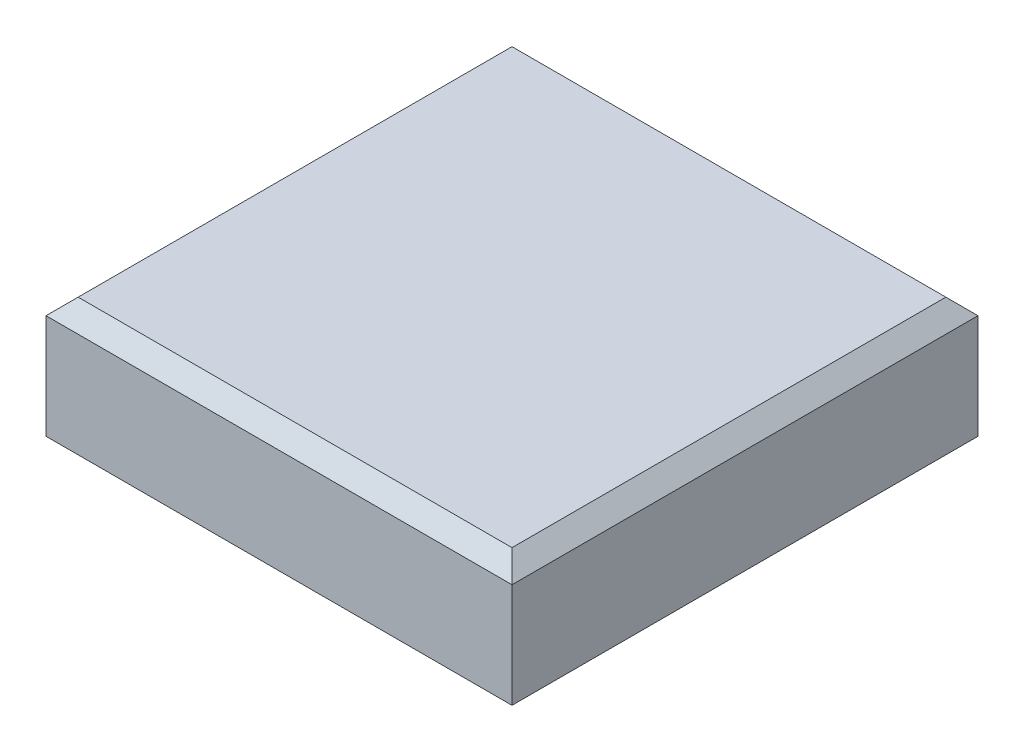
from build123d import *

# Parameters (mm, degrees)
SKETCH1_W           = 290
SKETCH1_H           = 290
BOSS_EXTRUDE1_DEPTH = 75
CHAMFER1_SIZE       = 10


with BuildPart() as part:
    # Sketch1 → Boss-Extrude1 (new body)
    with BuildSketch(Plane(origin=(0, 0, 0), x_dir=(1, 0, 0), z_dir=(0, 1, 0))):
        with Locations((0, 145)):
            Rectangle(SKETCH1_W, SKETCH1_H)
    extrude(amount=BOSS_EXTRUDE1_DEPTH)

    # Chamfer1
    chamfer1_edges = [part.edges().sort_by_distance(p)[0] for p in [
        (145, 75, -145),
        (0, 75, -290),
        (-145, 75, -145),
        (0, 75, 0),
    ]]
    chamfer(chamfer1_edges, length=CHAMFER1_SIZE)


solid = part.part
